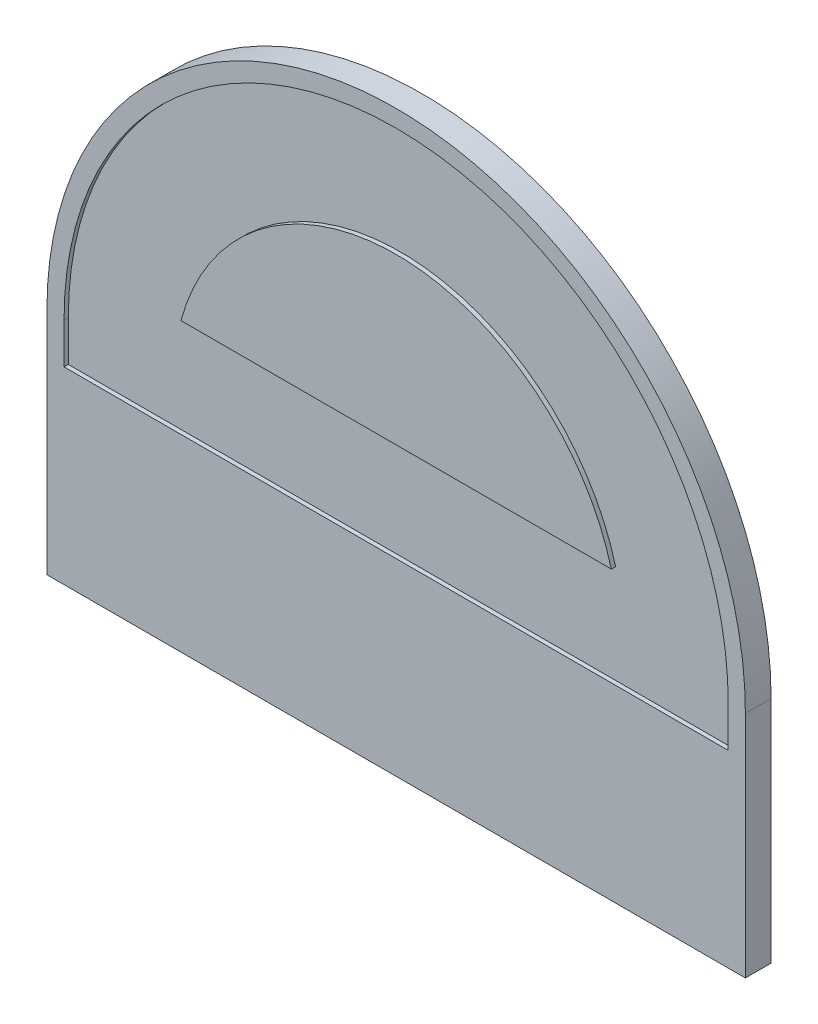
ISO-10303-21;
HEADER;
FILE_DESCRIPTION(('STEP AP214'),'2;1');
FILE_NAME('part.step','',(''),(''),'','','');
FILE_SCHEMA(('AUTOMOTIVE_DESIGN { 1 0 10303 214 1 1 1 1 }'));
ENDSEC;
DATA;
#1=APPLICATION_CONTEXT('core data for automotive mechanical design processes');
#2=APPLICATION_PROTOCOL_DEFINITION('international standard','automotive_design',2000,#1);
#3=PRODUCT_CONTEXT('',#1,'mechanical');
#4=PRODUCT('Part','Part','',(#3));
#5=PRODUCT_RELATED_PRODUCT_CATEGORY('part','',(#4));
#6=PRODUCT_DEFINITION_FORMATION('','',#4);
#7=PRODUCT_DEFINITION_CONTEXT('part definition',#1,'design');
#8=PRODUCT_DEFINITION('design','',#6,#7);
#9=PRODUCT_DEFINITION_SHAPE('','',#8);
#10=(LENGTH_UNIT() NAMED_UNIT(*) SI_UNIT(.MILLI.,.METRE.));
#11=(NAMED_UNIT(*) PLANE_ANGLE_UNIT() SI_UNIT($,.RADIAN.));
#12=(NAMED_UNIT(*) SI_UNIT($,.STERADIAN.) SOLID_ANGLE_UNIT());
#13=UNCERTAINTY_MEASURE_WITH_UNIT(LENGTH_MEASURE(1.E-05),#10,'distance_accuracy_value','');
#14=(GEOMETRIC_REPRESENTATION_CONTEXT(3) GLOBAL_UNCERTAINTY_ASSIGNED_CONTEXT((#13)) GLOBAL_UNIT_ASSIGNED_CONTEXT((#10,
#11,#12)) REPRESENTATION_CONTEXT('',''));
#15=CARTESIAN_POINT('',(0.,0.,0.));
#16=DIRECTION('',(0.,0.,1.));
#17=DIRECTION('',(1.,0.,0.));
#18=AXIS2_PLACEMENT_3D('',#15,#16,#17);
#19=CARTESIAN_POINT('',(0.,0.,5.));
#20=DIRECTION('',(0.,0.,1.));
#21=DIRECTION('',(1.,0.,0.));
#22=AXIS2_PLACEMENT_3D('',#19,#20,#21);
#23=PLANE('',#22);
#24=CARTESIAN_POINT('',(0.,0.,5.));
#25=DIRECTION('',(0.,0.,1.));
#26=DIRECTION('',(1.,0.,0.));
#27=AXIS2_PLACEMENT_3D('',#24,#25,#26);
#28=CIRCLE('',#27,52.);
#29=CARTESIAN_POINT('',(50.2170289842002,13.5,5.));
#30=VERTEX_POINT('',#29);
#31=CARTESIAN_POINT('',(-50.2170289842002,13.5,5.));
#32=VERTEX_POINT('',#31);
#33=EDGE_CURVE('E191',#30,#32,#28,.T.);
#34=ORIENTED_EDGE('',*,*,#33,.F.);
#35=DIRECTION('',(1.,0.,0.));
#36=VECTOR('',#35,1.);
#37=CARTESIAN_POINT('',(0.,13.5,5.));
#38=LINE('',#37,#36);
#39=EDGE_CURVE('E143',#32,#30,#38,.T.);
#40=ORIENTED_EDGE('',*,*,#39,.F.);
#41=EDGE_LOOP('',(#34,#40));
#42=FACE_BOUND('',#41,.T.);
#43=DIRECTION('',(0.,1.,0.));
#44=VECTOR('',#43,1.);
#45=CARTESIAN_POINT('',(77.5,0.,5.));
#46=LINE('',#45,#44);
#47=CARTESIAN_POINT('',(77.5,-9.49999999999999,5.));
#48=VERTEX_POINT('',#47);
#49=CARTESIAN_POINT('',(77.5,0.,5.));
#50=VERTEX_POINT('',#49);
#51=EDGE_CURVE('E204',#48,#50,#46,.T.);
#52=ORIENTED_EDGE('',*,*,#51,.T.);
#53=CARTESIAN_POINT('',(0.,0.,5.));
#54=DIRECTION('',(0.,0.,1.));
#55=DIRECTION('',(1.,0.,0.));
#56=AXIS2_PLACEMENT_3D('',#53,#54,#55);
#57=CIRCLE('',#56,77.5);
#58=CARTESIAN_POINT('',(-77.5,0.,5.));
#59=VERTEX_POINT('',#58);
#60=EDGE_CURVE('E206',#50,#59,#57,.T.);
#61=ORIENTED_EDGE('',*,*,#60,.T.);
#62=DIRECTION('',(0.,1.,0.));
#63=VECTOR('',#62,1.);
#64=CARTESIAN_POINT('',(-77.5,0.,5.));
#65=LINE('',#64,#63);
#66=CARTESIAN_POINT('',(-77.5,-9.49999999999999,5.));
#67=VERTEX_POINT('',#66);
#68=EDGE_CURVE('E61',#67,#59,#65,.T.);
#69=ORIENTED_EDGE('',*,*,#68,.F.);
#70=DIRECTION('',(1.,0.,0.));
#71=VECTOR('',#70,1.);
#72=CARTESIAN_POINT('',(0.,-9.49999999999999,5.));
#73=LINE('',#72,#71);
#74=EDGE_CURVE('E12',#67,#48,#73,.T.);
#75=ORIENTED_EDGE('',*,*,#74,.T.);
#76=EDGE_LOOP('',(#52,#61,#69,#75));
#77=FACE_BOUND('',#76,.T.);
#78=ADVANCED_FACE('F53',(#42,#77),#23,.T.);
#79=CARTESIAN_POINT('',(0.,0.,0.));
#80=DIRECTION('',(0.,0.,1.));
#81=DIRECTION('',(1.,0.,0.));
#82=AXIS2_PLACEMENT_3D('',#79,#80,#81);
#83=PLANE('',#82);
#84=CARTESIAN_POINT('',(0.,0.,0.));
#85=DIRECTION('',(0.,0.,1.));
#86=DIRECTION('',(1.,0.,0.));
#87=AXIS2_PLACEMENT_3D('',#84,#85,#86);
#88=CIRCLE('',#87,3.475);
#89=CARTESIAN_POINT('',(3.475,0.,0.));
#90=VERTEX_POINT('',#89);
#91=EDGE_CURVE('E296',#90,#90,#88,.T.);
#92=ORIENTED_EDGE('',*,*,#91,.T.);
#93=EDGE_LOOP('',(#92));
#94=FACE_BOUND('',#93,.T.);
#95=DIRECTION('',(0.,1.,0.));
#96=VECTOR('',#95,1.);
#97=CARTESIAN_POINT('',(81.5,0.,0.));
#98=LINE('',#97,#96);
#99=CARTESIAN_POINT('',(81.5,-53.5,0.));
#100=VERTEX_POINT('',#99);
#101=CARTESIAN_POINT('',(81.5,0.,0.));
#102=VERTEX_POINT('',#101);
#103=EDGE_CURVE('E144',#100,#102,#98,.T.);
#104=ORIENTED_EDGE('',*,*,#103,.F.);
#105=DIRECTION('',(1.,0.,0.));
#106=VECTOR('',#105,1.);
#107=CARTESIAN_POINT('',(0.,-53.5,0.));
#108=LINE('',#107,#106);
#109=CARTESIAN_POINT('',(-81.5,-53.5,0.));
#110=VERTEX_POINT('',#109);
#111=EDGE_CURVE('E155',#110,#100,#108,.T.);
#112=ORIENTED_EDGE('',*,*,#111,.F.);
#113=DIRECTION('',(0.,1.,0.));
#114=VECTOR('',#113,1.);
#115=CARTESIAN_POINT('',(-81.5,0.,0.));
#116=LINE('',#115,#114);
#117=CARTESIAN_POINT('',(-81.5,0.,0.));
#118=VERTEX_POINT('',#117);
#119=EDGE_CURVE('E176',#110,#118,#116,.T.);
#120=ORIENTED_EDGE('',*,*,#119,.T.);
#121=CARTESIAN_POINT('',(0.,0.,0.));
#122=DIRECTION('',(0.,0.,1.));
#123=DIRECTION('',(1.,0.,0.));
#124=AXIS2_PLACEMENT_3D('',#121,#122,#123);
#125=CIRCLE('',#124,81.5);
#126=EDGE_CURVE('E147',#102,#118,#125,.T.);
#127=ORIENTED_EDGE('',*,*,#126,.F.);
#128=EDGE_LOOP('',(#104,#112,#120,#127));
#129=FACE_BOUND('',#128,.T.);
#130=ADVANCED_FACE('F55',(#94,#129),#83,.F.);
#131=CARTESIAN_POINT('',(81.5,0.,6.));
#132=DIRECTION('',(-1.,0.,0.));
#133=DIRECTION('',(0.,0.,1.));
#134=AXIS2_PLACEMENT_3D('',#131,#132,#133);
#135=PLANE('',#134);
#136=ORIENTED_EDGE('',*,*,#103,.T.);
#137=DIRECTION('',(0.,0.,-1.));
#138=VECTOR('',#137,1.);
#139=CARTESIAN_POINT('',(81.5,0.,6.));
#140=LINE('',#139,#138);
#141=CARTESIAN_POINT('',(81.5,0.,6.));
#142=VERTEX_POINT('',#141);
#143=EDGE_CURVE('E188',#142,#102,#140,.T.);
#144=ORIENTED_EDGE('',*,*,#143,.F.);
#145=DIRECTION('',(0.,1.,0.));
#146=VECTOR('',#145,1.);
#147=CARTESIAN_POINT('',(81.5,0.,6.));
#148=LINE('',#147,#146);
#149=CARTESIAN_POINT('',(81.5,-53.5,6.));
#150=VERTEX_POINT('',#149);
#151=EDGE_CURVE('E163',#150,#142,#148,.T.);
#152=ORIENTED_EDGE('',*,*,#151,.F.);
#153=DIRECTION('',(0.,0.,-1.));
#154=VECTOR('',#153,1.);
#155=CARTESIAN_POINT('',(81.5,-53.5,6.));
#156=LINE('',#155,#154);
#157=EDGE_CURVE('E180',#150,#100,#156,.T.);
#158=ORIENTED_EDGE('',*,*,#157,.T.);
#159=EDGE_LOOP('',(#136,#144,#152,#158));
#160=FACE_BOUND('',#159,.T.);
#161=ADVANCED_FACE('F238',(#160),#135,.F.);
#162=CARTESIAN_POINT('',(0.,0.,6.));
#163=DIRECTION('',(0.,0.,-1.));
#164=DIRECTION('',(-1.,0.,0.));
#165=AXIS2_PLACEMENT_3D('',#162,#163,#164);
#166=CYLINDRICAL_SURFACE('',#165,81.5);
#167=ORIENTED_EDGE('',*,*,#126,.T.);
#168=DIRECTION('',(0.,0.,-1.));
#169=VECTOR('',#168,1.);
#170=CARTESIAN_POINT('',(-81.5,0.,6.));
#171=LINE('',#170,#169);
#172=CARTESIAN_POINT('',(-81.5,0.,6.));
#173=VERTEX_POINT('',#172);
#174=EDGE_CURVE('E186',#173,#118,#171,.T.);
#175=ORIENTED_EDGE('',*,*,#174,.F.);
#176=CARTESIAN_POINT('',(0.,0.,6.));
#177=DIRECTION('',(0.,0.,1.));
#178=DIRECTION('',(1.,0.,0.));
#179=AXIS2_PLACEMENT_3D('',#176,#177,#178);
#180=CIRCLE('',#179,81.5);
#181=EDGE_CURVE('E166',#142,#173,#180,.T.);
#182=ORIENTED_EDGE('',*,*,#181,.F.);
#183=ORIENTED_EDGE('',*,*,#143,.T.);
#184=EDGE_LOOP('',(#167,#175,#182,#183));
#185=FACE_BOUND('',#184,.T.);
#186=ADVANCED_FACE('F246',(#185),#166,.T.);
#187=CARTESIAN_POINT('',(-81.5,0.,6.));
#188=DIRECTION('',(-1.,0.,0.));
#189=DIRECTION('',(0.,0.,1.));
#190=AXIS2_PLACEMENT_3D('',#187,#188,#189);
#191=PLANE('',#190);
#192=ORIENTED_EDGE('',*,*,#119,.F.);
#193=DIRECTION('',(0.,0.,-1.));
#194=VECTOR('',#193,1.);
#195=CARTESIAN_POINT('',(-81.5,-53.5,6.));
#196=LINE('',#195,#194);
#197=CARTESIAN_POINT('',(-81.5,-53.5,6.));
#198=VERTEX_POINT('',#197);
#199=EDGE_CURVE('E183',#198,#110,#196,.T.);
#200=ORIENTED_EDGE('',*,*,#199,.F.);
#201=DIRECTION('',(0.,1.,0.));
#202=VECTOR('',#201,1.);
#203=CARTESIAN_POINT('',(-81.5,0.,6.));
#204=LINE('',#203,#202);
#205=EDGE_CURVE('E168',#198,#173,#204,.T.);
#206=ORIENTED_EDGE('',*,*,#205,.T.);
#207=ORIENTED_EDGE('',*,*,#174,.T.);
#208=EDGE_LOOP('',(#192,#200,#206,#207));
#209=FACE_BOUND('',#208,.T.);
#210=ADVANCED_FACE('F242',(#209),#191,.T.);
#211=CARTESIAN_POINT('',(0.,0.,6.));
#212=DIRECTION('',(0.,0.,-1.));
#213=DIRECTION('',(-1.,0.,0.));
#214=AXIS2_PLACEMENT_3D('',#211,#212,#213);
#215=CYLINDRICAL_SURFACE('',#214,77.5);
#216=DIRECTION('',(0.,0.,-1.));
#217=VECTOR('',#216,1.);
#218=CARTESIAN_POINT('',(-77.5,0.,6.));
#219=LINE('',#218,#217);
#220=CARTESIAN_POINT('',(-77.5,0.,6.));
#221=VERTEX_POINT('',#220);
#222=EDGE_CURVE('E172',#221,#59,#219,.T.);
#223=ORIENTED_EDGE('',*,*,#222,.T.);
#224=ORIENTED_EDGE('',*,*,#60,.F.);
#225=DIRECTION('',(0.,0.,-1.));
#226=VECTOR('',#225,1.);
#227=CARTESIAN_POINT('',(77.5,0.,6.));
#228=LINE('',#227,#226);
#229=CARTESIAN_POINT('',(77.5,0.,6.));
#230=VERTEX_POINT('',#229);
#231=EDGE_CURVE('E184',#230,#50,#228,.T.);
#232=ORIENTED_EDGE('',*,*,#231,.F.);
#233=CARTESIAN_POINT('',(0.,0.,6.));
#234=DIRECTION('',(0.,0.,1.));
#235=DIRECTION('',(1.,0.,0.));
#236=AXIS2_PLACEMENT_3D('',#233,#234,#235);
#237=CIRCLE('',#236,77.5);
#238=EDGE_CURVE('E151',#230,#221,#237,.T.);
#239=ORIENTED_EDGE('',*,*,#238,.T.);
#240=EDGE_LOOP('',(#223,#224,#232,#239));
#241=FACE_BOUND('',#240,.T.);
#242=ADVANCED_FACE('F213',(#241),#215,.F.);
#243=CARTESIAN_POINT('',(77.5,0.,6.));
#244=DIRECTION('',(-1.,0.,0.));
#245=DIRECTION('',(0.,0.,1.));
#246=AXIS2_PLACEMENT_3D('',#243,#244,#245);
#247=PLANE('',#246);
#248=ORIENTED_EDGE('',*,*,#231,.T.);
#249=ORIENTED_EDGE('',*,*,#51,.F.);
#250=DIRECTION('',(0.,0.,-1.));
#251=VECTOR('',#250,1.);
#252=CARTESIAN_POINT('',(77.5,-9.49999999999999,6.));
#253=LINE('',#252,#251);
#254=CARTESIAN_POINT('',(77.5,-9.49999999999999,6.));
#255=VERTEX_POINT('',#254);
#256=EDGE_CURVE('E197',#255,#48,#253,.T.);
#257=ORIENTED_EDGE('',*,*,#256,.F.);
#258=DIRECTION('',(0.,1.,0.));
#259=VECTOR('',#258,1.);
#260=CARTESIAN_POINT('',(77.5,0.,6.));
#261=LINE('',#260,#259);
#262=EDGE_CURVE('E154',#255,#230,#261,.T.);
#263=ORIENTED_EDGE('',*,*,#262,.T.);
#264=EDGE_LOOP('',(#248,#249,#257,#263));
#265=FACE_BOUND('',#264,.T.);
#266=ADVANCED_FACE('F221',(#265),#247,.T.);
#267=CARTESIAN_POINT('',(0.,-9.49999999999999,6.));
#268=DIRECTION('',(0.,1.,0.));
#269=DIRECTION('',(0.,0.,1.));
#270=AXIS2_PLACEMENT_3D('',#267,#268,#269);
#271=PLANE('',#270);
#272=ORIENTED_EDGE('',*,*,#256,.T.);
#273=ORIENTED_EDGE('',*,*,#74,.F.);
#274=DIRECTION('',(0.,0.,-1.));
#275=VECTOR('',#274,1.);
#276=CARTESIAN_POINT('',(-77.5,-9.49999999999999,6.));
#277=LINE('',#276,#275);
#278=CARTESIAN_POINT('',(-77.5,-9.49999999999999,6.));
#279=VERTEX_POINT('',#278);
#280=EDGE_CURVE('E194',#279,#67,#277,.T.);
#281=ORIENTED_EDGE('',*,*,#280,.F.);
#282=DIRECTION('',(1.,0.,0.));
#283=VECTOR('',#282,1.);
#284=CARTESIAN_POINT('',(0.,-9.49999999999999,6.));
#285=LINE('',#284,#283);
#286=EDGE_CURVE('E158',#279,#255,#285,.T.);
#287=ORIENTED_EDGE('',*,*,#286,.T.);
#288=EDGE_LOOP('',(#272,#273,#281,#287));
#289=FACE_BOUND('',#288,.T.);
#290=ADVANCED_FACE('F223',(#289),#271,.T.);
#291=CARTESIAN_POINT('',(-77.5,0.,6.));
#292=DIRECTION('',(-1.,0.,0.));
#293=DIRECTION('',(0.,0.,1.));
#294=AXIS2_PLACEMENT_3D('',#291,#292,#293);
#295=PLANE('',#294);
#296=ORIENTED_EDGE('',*,*,#68,.T.);
#297=ORIENTED_EDGE('',*,*,#222,.F.);
#298=DIRECTION('',(0.,1.,0.));
#299=VECTOR('',#298,1.);
#300=CARTESIAN_POINT('',(-77.5,0.,6.));
#301=LINE('',#300,#299);
#302=EDGE_CURVE('E161',#279,#221,#301,.T.);
#303=ORIENTED_EDGE('',*,*,#302,.F.);
#304=ORIENTED_EDGE('',*,*,#280,.T.);
#305=EDGE_LOOP('',(#296,#297,#303,#304));
#306=FACE_BOUND('',#305,.T.);
#307=ADVANCED_FACE('F209',(#306),#295,.F.);
#308=CARTESIAN_POINT('',(0.,-53.5,6.));
#309=DIRECTION('',(0.,1.,0.));
#310=DIRECTION('',(0.,0.,1.));
#311=AXIS2_PLACEMENT_3D('',#308,#309,#310);
#312=PLANE('',#311);
#313=ORIENTED_EDGE('',*,*,#111,.T.);
#314=ORIENTED_EDGE('',*,*,#157,.F.);
#315=DIRECTION('',(1.,0.,0.));
#316=VECTOR('',#315,1.);
#317=CARTESIAN_POINT('',(0.,-53.5,6.));
#318=LINE('',#317,#316);
#319=EDGE_CURVE('E171',#198,#150,#318,.T.);
#320=ORIENTED_EDGE('',*,*,#319,.F.);
#321=ORIENTED_EDGE('',*,*,#199,.T.);
#322=EDGE_LOOP('',(#313,#314,#320,#321));
#323=FACE_BOUND('',#322,.T.);
#324=ADVANCED_FACE('F230',(#323),#312,.F.);
#325=CARTESIAN_POINT('',(0.,0.,6.));
#326=DIRECTION('',(0.,0.,1.));
#327=DIRECTION('',(1.,0.,0.));
#328=AXIS2_PLACEMENT_3D('',#325,#326,#327);
#329=PLANE('',#328);
#330=ORIENTED_EDGE('',*,*,#238,.F.);
#331=ORIENTED_EDGE('',*,*,#262,.F.);
#332=ORIENTED_EDGE('',*,*,#286,.F.);
#333=ORIENTED_EDGE('',*,*,#302,.T.);
#334=EDGE_LOOP('',(#330,#331,#332,#333));
#335=FACE_BOUND('',#334,.T.);
#336=ORIENTED_EDGE('',*,*,#151,.T.);
#337=ORIENTED_EDGE('',*,*,#181,.T.);
#338=ORIENTED_EDGE('',*,*,#205,.F.);
#339=ORIENTED_EDGE('',*,*,#319,.T.);
#340=EDGE_LOOP('',(#336,#337,#338,#339));
#341=FACE_BOUND('',#340,.T.);
#342=ADVANCED_FACE('F217',(#335,#341),#329,.T.);
#343=CARTESIAN_POINT('',(0.,13.5,6.));
#344=DIRECTION('',(0.,1.,0.));
#345=DIRECTION('',(0.,0.,1.));
#346=AXIS2_PLACEMENT_3D('',#343,#344,#345);
#347=PLANE('',#346);
#348=ORIENTED_EDGE('',*,*,#39,.T.);
#349=DIRECTION('',(0.,0.,-1.));
#350=VECTOR('',#349,1.);
#351=CARTESIAN_POINT('',(50.2170289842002,13.5,6.));
#352=LINE('',#351,#350);
#353=CARTESIAN_POINT('',(50.2170289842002,13.5,6.));
#354=VERTEX_POINT('',#353);
#355=EDGE_CURVE('E130',#354,#30,#352,.T.);
#356=ORIENTED_EDGE('',*,*,#355,.F.);
#357=DIRECTION('',(1.,0.,0.));
#358=VECTOR('',#357,1.);
#359=CARTESIAN_POINT('',(0.,13.5,6.));
#360=LINE('',#359,#358);
#361=CARTESIAN_POINT('',(-50.2170289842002,13.5,6.));
#362=VERTEX_POINT('',#361);
#363=EDGE_CURVE('E135',#362,#354,#360,.T.);
#364=ORIENTED_EDGE('',*,*,#363,.F.);
#365=DIRECTION('',(0.,0.,-1.));
#366=VECTOR('',#365,1.);
#367=CARTESIAN_POINT('',(-50.2170289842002,13.5,6.));
#368=LINE('',#367,#366);
#369=EDGE_CURVE('E132',#362,#32,#368,.T.);
#370=ORIENTED_EDGE('',*,*,#369,.T.);
#371=EDGE_LOOP('',(#348,#356,#364,#370));
#372=FACE_BOUND('',#371,.T.);
#373=ADVANCED_FACE('F142',(#372),#347,.F.);
#374=CARTESIAN_POINT('',(0.,0.,6.));
#375=DIRECTION('',(0.,0.,-1.));
#376=DIRECTION('',(-1.,0.,0.));
#377=AXIS2_PLACEMENT_3D('',#374,#375,#376);
#378=CYLINDRICAL_SURFACE('',#377,52.);
#379=ORIENTED_EDGE('',*,*,#33,.T.);
#380=ORIENTED_EDGE('',*,*,#369,.F.);
#381=CARTESIAN_POINT('',(0.,0.,6.));
#382=DIRECTION('',(0.,0.,1.));
#383=DIRECTION('',(1.,0.,0.));
#384=AXIS2_PLACEMENT_3D('',#381,#382,#383);
#385=CIRCLE('',#384,52.);
#386=EDGE_CURVE('E125',#354,#362,#385,.T.);
#387=ORIENTED_EDGE('',*,*,#386,.F.);
#388=ORIENTED_EDGE('',*,*,#355,.T.);
#389=EDGE_LOOP('',(#379,#380,#387,#388));
#390=FACE_BOUND('',#389,.T.);
#391=ADVANCED_FACE('F128',(#390),#378,.T.);
#392=CARTESIAN_POINT('',(0.,0.,6.));
#393=DIRECTION('',(0.,0.,1.));
#394=DIRECTION('',(1.,0.,0.));
#395=AXIS2_PLACEMENT_3D('',#392,#393,#394);
#396=PLANE('',#395);
#397=ORIENTED_EDGE('',*,*,#363,.T.);
#398=ORIENTED_EDGE('',*,*,#386,.T.);
#399=EDGE_LOOP('',(#397,#398));
#400=FACE_BOUND('',#399,.T.);
#401=ADVANCED_FACE('F137',(#400),#396,.T.);
#402=CARTESIAN_POINT('',(0.,0.,3.));
#403=DIRECTION('',(0.,0.,-1.));
#404=DIRECTION('',(-1.,0.,0.));
#405=AXIS2_PLACEMENT_3D('',#402,#403,#404);
#406=CYLINDRICAL_SURFACE('',#405,3.475);
#407=CARTESIAN_POINT('',(0.,0.,3.));
#408=DIRECTION('',(0.,0.,1.));
#409=DIRECTION('',(1.,0.,0.));
#410=AXIS2_PLACEMENT_3D('',#407,#408,#409);
#411=CIRCLE('',#410,3.475);
#412=CARTESIAN_POINT('',(3.475,0.,3.));
#413=VERTEX_POINT('',#412);
#414=EDGE_CURVE('E139',#413,#413,#411,.T.);
#415=ORIENTED_EDGE('',*,*,#414,.T.);
#416=EDGE_LOOP('',(#415));
#417=FACE_BOUND('',#416,.T.);
#418=ORIENTED_EDGE('',*,*,#91,.F.);
#419=EDGE_LOOP('',(#418));
#420=FACE_BOUND('',#419,.T.);
#421=ADVANCED_FACE('F285',(#417,#420),#406,.F.);
#422=CARTESIAN_POINT('',(0.,0.,3.));
#423=DIRECTION('',(0.,0.,1.));
#424=DIRECTION('',(1.,0.,0.));
#425=AXIS2_PLACEMENT_3D('',#422,#423,#424);
#426=PLANE('',#425);
#427=ORIENTED_EDGE('',*,*,#414,.F.);
#428=EDGE_LOOP('',(#427));
#429=FACE_BOUND('',#428,.T.);
#430=ADVANCED_FACE('F288',(#429),#426,.F.);
#431=CLOSED_SHELL('',(#78,#130,#161,#186,#210,#242,#266,#290,#307,#324,#342,#373,#391,#401,#421,#430));
#432=MANIFOLD_SOLID_BREP('B2',#431);
#433=ADVANCED_BREP_SHAPE_REPRESENTATION('',(#18,#432),#14);
#434=SHAPE_DEFINITION_REPRESENTATION(#9,#433);
ENDSEC;
END-ISO-10303-21;
